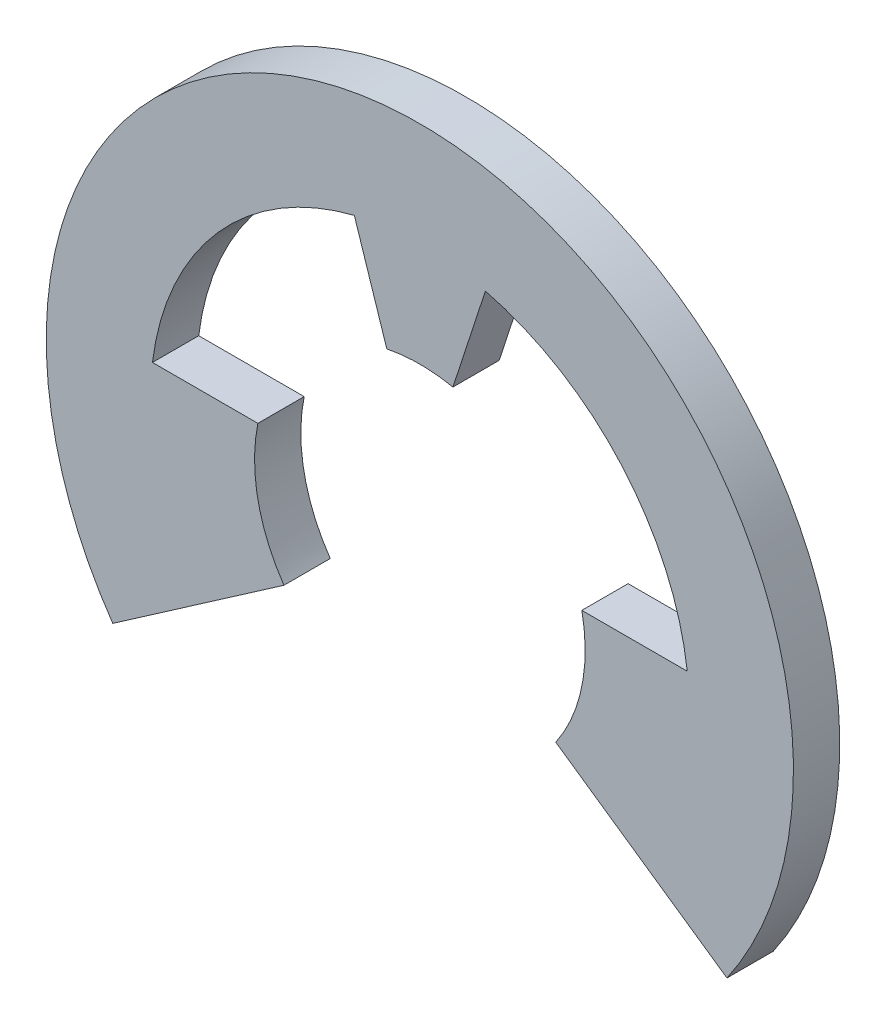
ISO-10303-21;
HEADER;
FILE_DESCRIPTION(('STEP AP214'),'2;1');
FILE_NAME('part.step','',(''),(''),'','','');
FILE_SCHEMA(('AUTOMOTIVE_DESIGN { 1 0 10303 214 1 1 1 1 }'));
ENDSEC;
DATA;
#1=APPLICATION_CONTEXT('core data for automotive mechanical design processes');
#2=APPLICATION_PROTOCOL_DEFINITION('international standard','automotive_design',2000,#1);
#3=PRODUCT_CONTEXT('',#1,'mechanical');
#4=PRODUCT('Part','Part','',(#3));
#5=PRODUCT_RELATED_PRODUCT_CATEGORY('part','',(#4));
#6=PRODUCT_DEFINITION_FORMATION('','',#4);
#7=PRODUCT_DEFINITION_CONTEXT('part definition',#1,'design');
#8=PRODUCT_DEFINITION('design','',#6,#7);
#9=PRODUCT_DEFINITION_SHAPE('','',#8);
#10=(LENGTH_UNIT() NAMED_UNIT(*) SI_UNIT(.MILLI.,.METRE.));
#11=(NAMED_UNIT(*) PLANE_ANGLE_UNIT() SI_UNIT($,.RADIAN.));
#12=(NAMED_UNIT(*) SI_UNIT($,.STERADIAN.) SOLID_ANGLE_UNIT());
#13=UNCERTAINTY_MEASURE_WITH_UNIT(LENGTH_MEASURE(1.E-05),#10,'distance_accuracy_value','');
#14=(GEOMETRIC_REPRESENTATION_CONTEXT(3) GLOBAL_UNCERTAINTY_ASSIGNED_CONTEXT((#13)) GLOBAL_UNIT_ASSIGNED_CONTEXT((#10,
#11,#12)) REPRESENTATION_CONTEXT('',''));
#15=CARTESIAN_POINT('',(0.,0.,0.));
#16=DIRECTION('',(0.,0.,1.));
#17=DIRECTION('',(1.,0.,0.));
#18=AXIS2_PLACEMENT_3D('',#15,#16,#17);
#19=CARTESIAN_POINT('',(0.,0.,0.7));
#20=DIRECTION('',(0.,0.,1.));
#21=DIRECTION('',(1.,0.,0.));
#22=AXIS2_PLACEMENT_3D('',#19,#20,#21);
#23=PLANE('',#22);
#24=DIRECTION('',(1.,0.,0.));
#25=VECTOR('',#24,1.);
#26=CARTESIAN_POINT('',(-2.449489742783,0.5,0.7));
#27=LINE('',#26,#25);
#28=CARTESIAN_POINT('',(-4.04420882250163,0.499999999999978,0.7));
#29=VERTEX_POINT('',#28);
#30=CARTESIAN_POINT('',(-2.44948974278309,0.5,0.7));
#31=VERTEX_POINT('',#30);
#32=EDGE_CURVE('E123',#29,#31,#27,.T.);
#33=ORIENTED_EDGE('',*,*,#32,.F.);
#34=CARTESIAN_POINT('',(0.,0.,0.7));
#35=DIRECTION('',(0.,0.,1.));
#36=DIRECTION('',(1.,0.,0.));
#37=AXIS2_PLACEMENT_3D('',#34,#35,#36);
#38=CIRCLE('',#37,4.075);
#39=CARTESIAN_POINT('',(-0.991020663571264,3.95265771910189,0.7));
#40=VERTEX_POINT('',#39);
#41=EDGE_CURVE('E114',#29,#40,#38,.F.);
#42=ORIENTED_EDGE('',*,*,#41,.T.);
#43=DIRECTION('',(0.310510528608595,-0.950569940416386,0.));
#44=VECTOR('',#43,1.);
#45=CARTESIAN_POINT('',(-0.9910206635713,3.952657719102,0.7));
#46=LINE('',#45,#44);
#47=CARTESIAN_POINT('',(-0.499999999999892,2.44948974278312,0.7));
#48=VERTEX_POINT('',#47);
#49=EDGE_CURVE('E112',#48,#40,#46,.F.);
#50=ORIENTED_EDGE('',*,*,#49,.F.);
#51=CARTESIAN_POINT('',(0.,0.,0.7));
#52=DIRECTION('',(0.,0.,1.));
#53=DIRECTION('',(1.,0.,0.));
#54=AXIS2_PLACEMENT_3D('',#51,#52,#53);
#55=CIRCLE('',#54,2.5);
#56=CARTESIAN_POINT('',(0.500000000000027,2.44948974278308,0.7));
#57=VERTEX_POINT('',#56);
#58=EDGE_CURVE('E19',#48,#57,#55,.F.);
#59=ORIENTED_EDGE('',*,*,#58,.T.);
#60=DIRECTION('',(0.310510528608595,0.950569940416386,0.));
#61=VECTOR('',#60,1.);
#62=CARTESIAN_POINT('',(0.5,2.449489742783,0.7));
#63=LINE('',#62,#61);
#64=CARTESIAN_POINT('',(0.991020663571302,3.95265771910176,0.7));
#65=VERTEX_POINT('',#64);
#66=EDGE_CURVE('E110',#65,#57,#63,.F.);
#67=ORIENTED_EDGE('',*,*,#66,.F.);
#68=CARTESIAN_POINT('',(0.,0.,0.7));
#69=DIRECTION('',(0.,0.,1.));
#70=DIRECTION('',(1.,0.,0.));
#71=AXIS2_PLACEMENT_3D('',#68,#69,#70);
#72=CIRCLE('',#71,4.075);
#73=CARTESIAN_POINT('',(4.04420882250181,0.5,0.7));
#74=VERTEX_POINT('',#73);
#75=EDGE_CURVE('E142',#65,#74,#72,.F.);
#76=ORIENTED_EDGE('',*,*,#75,.T.);
#77=DIRECTION('',(1.,0.,0.));
#78=VECTOR('',#77,1.);
#79=CARTESIAN_POINT('',(4.044208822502,0.5,0.7));
#80=LINE('',#79,#78);
#81=CARTESIAN_POINT('',(2.44948974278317,0.500000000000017,0.7));
#82=VERTEX_POINT('',#81);
#83=EDGE_CURVE('E138',#82,#74,#80,.T.);
#84=ORIENTED_EDGE('',*,*,#83,.F.);
#85=CARTESIAN_POINT('',(0.,0.,0.7));
#86=DIRECTION('',(0.,0.,1.));
#87=DIRECTION('',(1.,0.,0.));
#88=AXIS2_PLACEMENT_3D('',#85,#86,#87);
#89=CIRCLE('',#88,2.5);
#90=CARTESIAN_POINT('',(2.05500000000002,-1.42371872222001,0.7));
#91=VERTEX_POINT('',#90);
#92=EDGE_CURVE('E137',#82,#91,#89,.F.);
#93=ORIENTED_EDGE('',*,*,#92,.T.);
#94=DIRECTION('',(0.822000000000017,-0.569487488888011,0.));
#95=VECTOR('',#94,1.);
#96=CARTESIAN_POINT('',(2.055,-1.42371872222,0.7));
#97=LINE('',#96,#95);
#98=CARTESIAN_POINT('',(4.64430000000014,-3.2176043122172,0.7));
#99=VERTEX_POINT('',#98);
#100=EDGE_CURVE('E133',#99,#91,#97,.F.);
#101=ORIENTED_EDGE('',*,*,#100,.F.);
#102=CARTESIAN_POINT('',(0.,0.,0.7));
#103=DIRECTION('',(0.,0.,1.));
#104=DIRECTION('',(1.,0.,0.));
#105=AXIS2_PLACEMENT_3D('',#102,#103,#104);
#106=CIRCLE('',#105,5.65);
#107=CARTESIAN_POINT('',(-4.64430000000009,-3.21760431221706,0.7));
#108=VERTEX_POINT('',#107);
#109=EDGE_CURVE('E168',#108,#99,#106,.F.);
#110=ORIENTED_EDGE('',*,*,#109,.F.);
#111=DIRECTION('',(0.822000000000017,0.569487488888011,0.));
#112=VECTOR('',#111,1.);
#113=CARTESIAN_POINT('',(-4.6443,-3.217604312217,0.7));
#114=LINE('',#113,#112);
#115=CARTESIAN_POINT('',(-2.05500000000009,-1.42371872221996,0.7));
#116=VERTEX_POINT('',#115);
#117=EDGE_CURVE('E128',#116,#108,#114,.F.);
#118=ORIENTED_EDGE('',*,*,#117,.F.);
#119=CARTESIAN_POINT('',(0.,0.,0.7));
#120=DIRECTION('',(0.,0.,1.));
#121=DIRECTION('',(1.,0.,0.));
#122=AXIS2_PLACEMENT_3D('',#119,#120,#121);
#123=CIRCLE('',#122,2.5);
#124=EDGE_CURVE('E127',#116,#31,#123,.F.);
#125=ORIENTED_EDGE('',*,*,#124,.T.);
#126=EDGE_LOOP('',(#33,#42,#50,#59,#67,#76,#84,#93,#101,#110,#118,#125));
#127=FACE_BOUND('',#126,.T.);
#128=ADVANCED_FACE('F16',(#127),#23,.T.);
#129=CARTESIAN_POINT('',(0.,0.,0.));
#130=DIRECTION('',(0.,0.,1.));
#131=DIRECTION('',(1.,0.,0.));
#132=AXIS2_PLACEMENT_3D('',#129,#130,#131);
#133=CYLINDRICAL_SURFACE('',#132,2.5);
#134=DIRECTION('',(0.,0.,1.));
#135=VECTOR('',#134,1.);
#136=CARTESIAN_POINT('',(0.5,2.449489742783,0.));
#137=LINE('',#136,#135);
#138=CARTESIAN_POINT('',(0.500000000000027,2.44948974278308,0.));
#139=VERTEX_POINT('',#138);
#140=EDGE_CURVE('E106',#57,#139,#137,.F.);
#141=ORIENTED_EDGE('',*,*,#140,.F.);
#142=ORIENTED_EDGE('',*,*,#58,.F.);
#143=DIRECTION('',(0.,0.,1.));
#144=VECTOR('',#143,1.);
#145=CARTESIAN_POINT('',(-0.499999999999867,2.44948974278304,0.));
#146=LINE('',#145,#144);
#147=CARTESIAN_POINT('',(-0.499999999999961,2.44948974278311,0.));
#148=VERTEX_POINT('',#147);
#149=EDGE_CURVE('E105',#148,#48,#146,.T.);
#150=ORIENTED_EDGE('',*,*,#149,.F.);
#151=CARTESIAN_POINT('',(0.,0.,0.));
#152=DIRECTION('',(0.,0.,1.));
#153=DIRECTION('',(1.,0.,0.));
#154=AXIS2_PLACEMENT_3D('',#151,#152,#153);
#155=CIRCLE('',#154,2.5);
#156=EDGE_CURVE('E118',#148,#139,#155,.F.);
#157=ORIENTED_EDGE('',*,*,#156,.T.);
#158=EDGE_LOOP('',(#141,#142,#150,#157));
#159=FACE_BOUND('',#158,.T.);
#160=ADVANCED_FACE('F103',(#159),#133,.F.);
#161=CARTESIAN_POINT('',(0.5,2.449489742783,0.));
#162=DIRECTION('',(0.950569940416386,-0.310510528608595,0.));
#163=DIRECTION('',(0.310510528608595,0.950569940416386,0.));
#164=AXIS2_PLACEMENT_3D('',#161,#162,#163);
#165=PLANE('',#164);
#166=ORIENTED_EDGE('',*,*,#66,.T.);
#167=ORIENTED_EDGE('',*,*,#140,.T.);
#168=DIRECTION('',(0.310510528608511,0.950569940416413,0.));
#169=VECTOR('',#168,1.);
#170=CARTESIAN_POINT('',(0.5,2.449489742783,0.));
#171=LINE('',#170,#169);
#172=CARTESIAN_POINT('',(0.991020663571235,3.95265771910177,0.));
#173=VERTEX_POINT('',#172);
#174=EDGE_CURVE('E162',#139,#173,#171,.T.);
#175=ORIENTED_EDGE('',*,*,#174,.T.);
#176=DIRECTION('',(0.,0.,1.));
#177=VECTOR('',#176,1.);
#178=CARTESIAN_POINT('',(0.991020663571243,3.95265771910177,0.));
#179=LINE('',#178,#177);
#180=EDGE_CURVE('E172',#173,#65,#179,.T.);
#181=ORIENTED_EDGE('',*,*,#180,.T.);
#182=EDGE_LOOP('',(#166,#167,#175,#181));
#183=FACE_BOUND('',#182,.T.);
#184=ADVANCED_FACE('F222',(#183),#165,.T.);
#185=CARTESIAN_POINT('',(0.,0.,0.));
#186=DIRECTION('',(0.,0.,1.));
#187=DIRECTION('',(1.,0.,0.));
#188=AXIS2_PLACEMENT_3D('',#185,#186,#187);
#189=CYLINDRICAL_SURFACE('',#188,4.075);
#190=DIRECTION('',(0.,0.,1.));
#191=VECTOR('',#190,1.);
#192=CARTESIAN_POINT('',(4.044208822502,0.5,0.));
#193=LINE('',#192,#191);
#194=CARTESIAN_POINT('',(4.04420882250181,0.5,0.));
#195=VERTEX_POINT('',#194);
#196=EDGE_CURVE('E141',#74,#195,#193,.F.);
#197=ORIENTED_EDGE('',*,*,#196,.F.);
#198=ORIENTED_EDGE('',*,*,#75,.F.);
#199=ORIENTED_EDGE('',*,*,#180,.F.);
#200=CARTESIAN_POINT('',(0.,0.,0.));
#201=DIRECTION('',(0.,0.,1.));
#202=DIRECTION('',(1.,0.,0.));
#203=AXIS2_PLACEMENT_3D('',#200,#201,#202);
#204=CIRCLE('',#203,4.075);
#205=EDGE_CURVE('E159',#173,#195,#204,.F.);
#206=ORIENTED_EDGE('',*,*,#205,.T.);
#207=EDGE_LOOP('',(#197,#198,#199,#206));
#208=FACE_BOUND('',#207,.T.);
#209=ADVANCED_FACE('F226',(#208),#189,.F.);
#210=CARTESIAN_POINT('',(4.044208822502,0.5,0.));
#211=DIRECTION('',(0.,1.,0.));
#212=DIRECTION('',(0.,0.,1.));
#213=AXIS2_PLACEMENT_3D('',#210,#211,#212);
#214=PLANE('',#213);
#215=ORIENTED_EDGE('',*,*,#83,.T.);
#216=ORIENTED_EDGE('',*,*,#196,.T.);
#217=DIRECTION('',(1.,0.,0.));
#218=VECTOR('',#217,1.);
#219=CARTESIAN_POINT('',(0.,0.5,0.));
#220=LINE('',#219,#218);
#221=CARTESIAN_POINT('',(2.44948974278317,0.500000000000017,0.));
#222=VERTEX_POINT('',#221);
#223=EDGE_CURVE('E158',#195,#222,#220,.F.);
#224=ORIENTED_EDGE('',*,*,#223,.T.);
#225=DIRECTION('',(0.,0.,1.));
#226=VECTOR('',#225,1.);
#227=CARTESIAN_POINT('',(2.44948974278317,0.500000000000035,0.));
#228=LINE('',#227,#226);
#229=EDGE_CURVE('E171',#222,#82,#228,.T.);
#230=ORIENTED_EDGE('',*,*,#229,.T.);
#231=EDGE_LOOP('',(#215,#216,#224,#230));
#232=FACE_BOUND('',#231,.T.);
#233=ADVANCED_FACE('F231',(#232),#214,.T.);
#234=CARTESIAN_POINT('',(0.,0.,0.));
#235=DIRECTION('',(0.,0.,1.));
#236=DIRECTION('',(1.,0.,0.));
#237=AXIS2_PLACEMENT_3D('',#234,#235,#236);
#238=CYLINDRICAL_SURFACE('',#237,2.5);
#239=DIRECTION('',(0.,0.,1.));
#240=VECTOR('',#239,1.);
#241=CARTESIAN_POINT('',(2.055,-1.42371872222,0.));
#242=LINE('',#241,#240);
#243=CARTESIAN_POINT('',(2.05500000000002,-1.42371872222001,0.));
#244=VERTEX_POINT('',#243);
#245=EDGE_CURVE('E136',#91,#244,#242,.F.);
#246=ORIENTED_EDGE('',*,*,#245,.F.);
#247=ORIENTED_EDGE('',*,*,#92,.F.);
#248=ORIENTED_EDGE('',*,*,#229,.F.);
#249=CARTESIAN_POINT('',(0.,0.,0.));
#250=DIRECTION('',(0.,0.,1.));
#251=DIRECTION('',(1.,0.,0.));
#252=AXIS2_PLACEMENT_3D('',#249,#250,#251);
#253=CIRCLE('',#252,2.5);
#254=EDGE_CURVE('E155',#222,#244,#253,.F.);
#255=ORIENTED_EDGE('',*,*,#254,.T.);
#256=EDGE_LOOP('',(#246,#247,#248,#255));
#257=FACE_BOUND('',#256,.T.);
#258=ADVANCED_FACE('F235',(#257),#238,.F.);
#259=CARTESIAN_POINT('',(2.055,-1.42371872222,0.));
#260=DIRECTION('',(-0.569487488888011,-0.822000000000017,0.));
#261=DIRECTION('',(0.822000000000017,-0.569487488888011,0.));
#262=AXIS2_PLACEMENT_3D('',#259,#260,#261);
#263=PLANE('',#262);
#264=ORIENTED_EDGE('',*,*,#100,.T.);
#265=ORIENTED_EDGE('',*,*,#245,.T.);
#266=DIRECTION('',(0.822000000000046,-0.569487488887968,0.));
#267=VECTOR('',#266,1.);
#268=CARTESIAN_POINT('',(2.055,-1.42371872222,0.));
#269=LINE('',#268,#267);
#270=CARTESIAN_POINT('',(4.64430000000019,-3.21760431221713,0.));
#271=VERTEX_POINT('',#270);
#272=EDGE_CURVE('E154',#244,#271,#269,.T.);
#273=ORIENTED_EDGE('',*,*,#272,.T.);
#274=DIRECTION('',(0.,0.,1.));
#275=VECTOR('',#274,1.);
#276=CARTESIAN_POINT('',(4.64430000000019,-3.21760431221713,0.));
#277=LINE('',#276,#275);
#278=EDGE_CURVE('E132',#99,#271,#277,.F.);
#279=ORIENTED_EDGE('',*,*,#278,.F.);
#280=EDGE_LOOP('',(#264,#265,#273,#279));
#281=FACE_BOUND('',#280,.T.);
#282=ADVANCED_FACE('F239',(#281),#263,.T.);
#283=CARTESIAN_POINT('',(0.,0.,0.));
#284=DIRECTION('',(0.,0.,1.));
#285=DIRECTION('',(1.,0.,0.));
#286=AXIS2_PLACEMENT_3D('',#283,#284,#285);
#287=CYLINDRICAL_SURFACE('',#286,5.65);
#288=ORIENTED_EDGE('',*,*,#109,.T.);
#289=ORIENTED_EDGE('',*,*,#278,.T.);
#290=CARTESIAN_POINT('',(0.,0.,0.));
#291=DIRECTION('',(0.,0.,1.));
#292=DIRECTION('',(1.,0.,0.));
#293=AXIS2_PLACEMENT_3D('',#290,#291,#292);
#294=CIRCLE('',#293,5.65);
#295=CARTESIAN_POINT('',(-4.64430000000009,-3.21760431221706,0.));
#296=VERTEX_POINT('',#295);
#297=EDGE_CURVE('E151',#271,#296,#294,.T.);
#298=ORIENTED_EDGE('',*,*,#297,.T.);
#299=DIRECTION('',(0.,0.,1.));
#300=VECTOR('',#299,1.);
#301=CARTESIAN_POINT('',(-4.6443,-3.217604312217,0.));
#302=LINE('',#301,#300);
#303=EDGE_CURVE('E131',#108,#296,#302,.F.);
#304=ORIENTED_EDGE('',*,*,#303,.F.);
#305=EDGE_LOOP('',(#288,#289,#298,#304));
#306=FACE_BOUND('',#305,.T.);
#307=ADVANCED_FACE('F243',(#306),#287,.T.);
#308=CARTESIAN_POINT('',(-4.6443,-3.217604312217,0.));
#309=DIRECTION('',(0.569487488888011,-0.822000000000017,0.));
#310=DIRECTION('',(0.822000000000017,0.569487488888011,0.));
#311=AXIS2_PLACEMENT_3D('',#308,#309,#310);
#312=PLANE('',#311);
#313=ORIENTED_EDGE('',*,*,#117,.T.);
#314=ORIENTED_EDGE('',*,*,#303,.T.);
#315=DIRECTION('',(0.822000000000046,0.569487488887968,0.));
#316=VECTOR('',#315,1.);
#317=CARTESIAN_POINT('',(-4.6443,-3.217604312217,0.));
#318=LINE('',#317,#316);
#319=CARTESIAN_POINT('',(-2.05500000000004,-1.42371872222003,0.));
#320=VERTEX_POINT('',#319);
#321=EDGE_CURVE('E150',#296,#320,#318,.T.);
#322=ORIENTED_EDGE('',*,*,#321,.T.);
#323=DIRECTION('',(0.,0.,1.));
#324=VECTOR('',#323,1.);
#325=CARTESIAN_POINT('',(-2.05500000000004,-1.42371872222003,0.));
#326=LINE('',#325,#324);
#327=EDGE_CURVE('E167',#320,#116,#326,.T.);
#328=ORIENTED_EDGE('',*,*,#327,.T.);
#329=EDGE_LOOP('',(#313,#314,#322,#328));
#330=FACE_BOUND('',#329,.T.);
#331=ADVANCED_FACE('F247',(#330),#312,.T.);
#332=CARTESIAN_POINT('',(0.,0.,0.));
#333=DIRECTION('',(0.,0.,1.));
#334=DIRECTION('',(1.,0.,0.));
#335=AXIS2_PLACEMENT_3D('',#332,#333,#334);
#336=CYLINDRICAL_SURFACE('',#335,2.5);
#337=DIRECTION('',(0.,0.,1.));
#338=VECTOR('',#337,1.);
#339=CARTESIAN_POINT('',(-2.449489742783,0.5,0.));
#340=LINE('',#339,#338);
#341=CARTESIAN_POINT('',(-2.44948974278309,0.5,0.));
#342=VERTEX_POINT('',#341);
#343=EDGE_CURVE('E126',#31,#342,#340,.F.);
#344=ORIENTED_EDGE('',*,*,#343,.F.);
#345=ORIENTED_EDGE('',*,*,#124,.F.);
#346=ORIENTED_EDGE('',*,*,#327,.F.);
#347=CARTESIAN_POINT('',(0.,0.,0.));
#348=DIRECTION('',(0.,0.,1.));
#349=DIRECTION('',(1.,0.,0.));
#350=AXIS2_PLACEMENT_3D('',#347,#348,#349);
#351=CIRCLE('',#350,2.5);
#352=EDGE_CURVE('E147',#320,#342,#351,.F.);
#353=ORIENTED_EDGE('',*,*,#352,.T.);
#354=EDGE_LOOP('',(#344,#345,#346,#353));
#355=FACE_BOUND('',#354,.T.);
#356=ADVANCED_FACE('F216',(#355),#336,.F.);
#357=CARTESIAN_POINT('',(-2.449489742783,0.5,0.));
#358=DIRECTION('',(0.,1.,0.));
#359=DIRECTION('',(0.,0.,1.));
#360=AXIS2_PLACEMENT_3D('',#357,#358,#359);
#361=PLANE('',#360);
#362=ORIENTED_EDGE('',*,*,#32,.T.);
#363=ORIENTED_EDGE('',*,*,#343,.T.);
#364=DIRECTION('',(1.,0.,0.));
#365=VECTOR('',#364,1.);
#366=CARTESIAN_POINT('',(0.,0.5,0.));
#367=LINE('',#366,#365);
#368=CARTESIAN_POINT('',(-4.04420882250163,0.499999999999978,0.));
#369=VERTEX_POINT('',#368);
#370=EDGE_CURVE('E146',#342,#369,#367,.F.);
#371=ORIENTED_EDGE('',*,*,#370,.T.);
#372=DIRECTION('',(0.,0.,1.));
#373=VECTOR('',#372,1.);
#374=CARTESIAN_POINT('',(-4.04420882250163,0.499999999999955,0.));
#375=LINE('',#374,#373);
#376=EDGE_CURVE('E165',#369,#29,#375,.T.);
#377=ORIENTED_EDGE('',*,*,#376,.T.);
#378=EDGE_LOOP('',(#362,#363,#371,#377));
#379=FACE_BOUND('',#378,.T.);
#380=ADVANCED_FACE('F201',(#379),#361,.T.);
#381=CARTESIAN_POINT('',(0.,0.,0.));
#382=DIRECTION('',(0.,0.,1.));
#383=DIRECTION('',(1.,0.,0.));
#384=AXIS2_PLACEMENT_3D('',#381,#382,#383);
#385=CYLINDRICAL_SURFACE('',#384,4.075);
#386=DIRECTION('',(0.,0.,1.));
#387=VECTOR('',#386,1.);
#388=CARTESIAN_POINT('',(-0.9910206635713,3.952657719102,0.));
#389=LINE('',#388,#387);
#390=CARTESIAN_POINT('',(-0.991020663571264,3.95265771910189,0.));
#391=VERTEX_POINT('',#390);
#392=EDGE_CURVE('E33',#40,#391,#389,.F.);
#393=ORIENTED_EDGE('',*,*,#392,.F.);
#394=ORIENTED_EDGE('',*,*,#41,.F.);
#395=ORIENTED_EDGE('',*,*,#376,.F.);
#396=CARTESIAN_POINT('',(0.,0.,0.));
#397=DIRECTION('',(0.,0.,1.));
#398=DIRECTION('',(1.,0.,0.));
#399=AXIS2_PLACEMENT_3D('',#396,#397,#398);
#400=CIRCLE('',#399,4.075);
#401=EDGE_CURVE('E25',#369,#391,#400,.F.);
#402=ORIENTED_EDGE('',*,*,#401,.T.);
#403=EDGE_LOOP('',(#393,#394,#395,#402));
#404=FACE_BOUND('',#403,.T.);
#405=ADVANCED_FACE('F207',(#404),#385,.F.);
#406=CARTESIAN_POINT('',(-0.9910206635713,3.952657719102,0.));
#407=DIRECTION('',(-0.950569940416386,-0.310510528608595,0.));
#408=DIRECTION('',(0.310510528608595,-0.950569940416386,0.));
#409=AXIS2_PLACEMENT_3D('',#406,#407,#408);
#410=PLANE('',#409);
#411=ORIENTED_EDGE('',*,*,#49,.T.);
#412=ORIENTED_EDGE('',*,*,#392,.T.);
#413=DIRECTION('',(0.310510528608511,-0.950569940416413,0.));
#414=VECTOR('',#413,1.);
#415=CARTESIAN_POINT('',(-0.9910206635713,3.952657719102,0.));
#416=LINE('',#415,#414);
#417=EDGE_CURVE('E11',#391,#148,#416,.T.);
#418=ORIENTED_EDGE('',*,*,#417,.T.);
#419=ORIENTED_EDGE('',*,*,#149,.T.);
#420=EDGE_LOOP('',(#411,#412,#418,#419));
#421=FACE_BOUND('',#420,.T.);
#422=ADVANCED_FACE('F111',(#421),#410,.T.);
#423=CARTESIAN_POINT('',(0.,0.,0.));
#424=DIRECTION('',(0.,0.,1.));
#425=DIRECTION('',(1.,0.,0.));
#426=AXIS2_PLACEMENT_3D('',#423,#424,#425);
#427=PLANE('',#426);
#428=ORIENTED_EDGE('',*,*,#401,.F.);
#429=ORIENTED_EDGE('',*,*,#370,.F.);
#430=ORIENTED_EDGE('',*,*,#352,.F.);
#431=ORIENTED_EDGE('',*,*,#321,.F.);
#432=ORIENTED_EDGE('',*,*,#297,.F.);
#433=ORIENTED_EDGE('',*,*,#272,.F.);
#434=ORIENTED_EDGE('',*,*,#254,.F.);
#435=ORIENTED_EDGE('',*,*,#223,.F.);
#436=ORIENTED_EDGE('',*,*,#205,.F.);
#437=ORIENTED_EDGE('',*,*,#174,.F.);
#438=ORIENTED_EDGE('',*,*,#156,.F.);
#439=ORIENTED_EDGE('',*,*,#417,.F.);
#440=EDGE_LOOP('',(#428,#429,#430,#431,#432,#433,#434,#435,#436,#437,#438,#439));
#441=FACE_BOUND('',#440,.T.);
#442=ADVANCED_FACE('F205',(#441),#427,.F.);
#443=CLOSED_SHELL('',(#128,#160,#184,#209,#233,#258,#282,#307,#331,#356,#380,#405,#422,#442));
#444=MANIFOLD_SOLID_BREP('B1',#443);
#445=ADVANCED_BREP_SHAPE_REPRESENTATION('',(#18,#444),#14);
#446=SHAPE_DEFINITION_REPRESENTATION(#9,#445);
ENDSEC;
END-ISO-10303-21;
